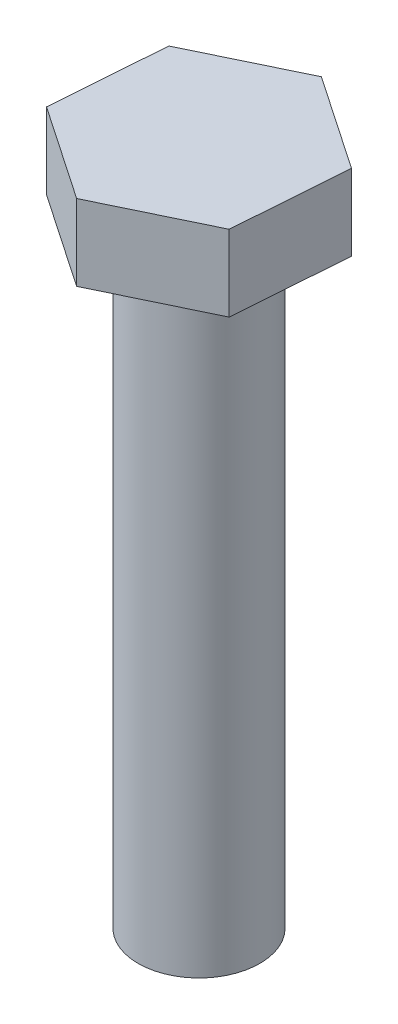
from build123d import *

# Parameters (mm, degrees)
SKETCH2_R           = 6.5
BOSS_EXTRUDE1_DEPTH = 5
SKETCH2_3_R         = 4
BOSS_EXTRUDE2_DEPTH = 40
BOSS_EXTRUDE3_DEPTH = 5


with BuildPart() as part:
    # Sketch2 → Boss-Extrude1 (new body)
    with BuildSketch(Plane(origin=(0, 0, 0), x_dir=(1, 0, 0), z_dir=(0, 1, 0))):
        with Locations(Location((0, 0, 0), (0, 0, 270))):
            Circle(SKETCH2_R)
    extrude(amount=BOSS_EXTRUDE1_DEPTH)

    # Sketch2_3 → Boss-Extrude2 (add)
    with BuildSketch(Plane(origin=(0, 0, 0), x_dir=(1, 0, 0), z_dir=(0, 1, 0))):
        with Locations(Location((0, 0, 0), (0, 0, 270))):
            Circle(SKETCH2_3_R)
    extrude(amount=-BOSS_EXTRUDE2_DEPTH)

    # Sketch3 → Boss-Extrude3 (add)
    with BuildSketch(Plane(origin=(0, 0, 0), x_dir=(1, 0, 0), z_dir=(0, 1, 0))):
        Polygon((-6.760475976, -3.260260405), (-0.556769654, -7.48487414), (6.203706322, -4.224613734), (6.760475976, 3.260260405), (0.556769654, 7.48487414), (-6.203706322, 4.224613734), align=None)
    extrude(amount=BOSS_EXTRUDE3_DEPTH)


solid = part.part
